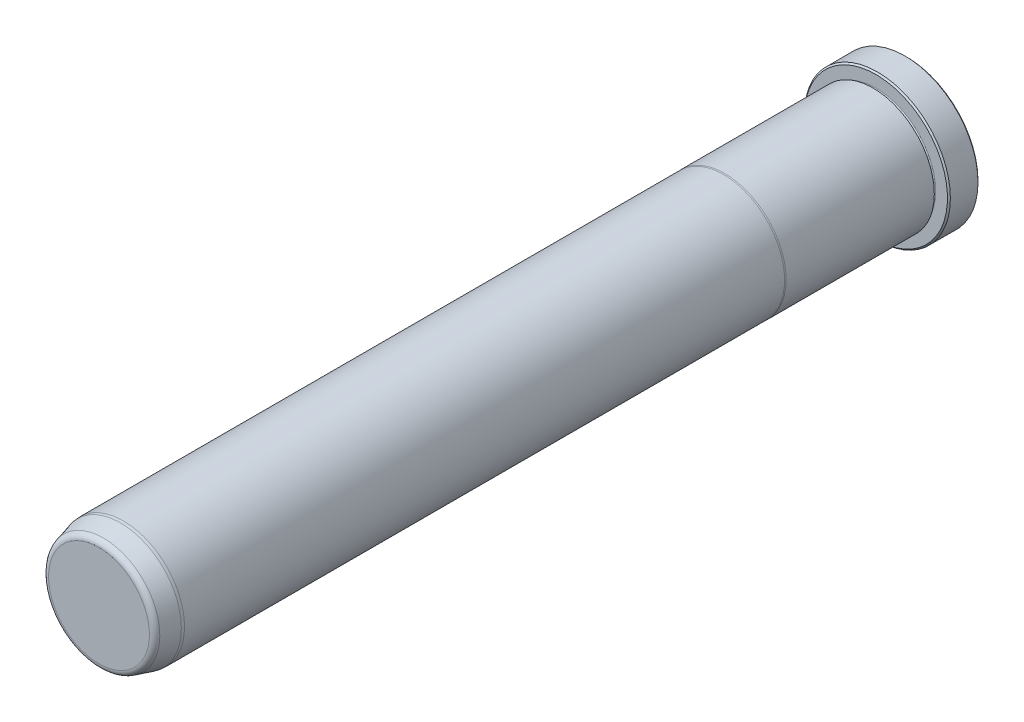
from build123d import *

# Parameters (mm, degrees)
FILLET6_R     = 1.5875
CHAMFER1_SIZE = 0.381


with BuildPart() as part:
    # Sketch1 → Revolve1 (revolve)
    with BuildSketch(Plane(origin=(0, 0, 0), x_dir=(0, 0, -1), z_dir=(1, 0, 0)), mode=Mode.PRIVATE) as revolve1_sk:
        with BuildLine():
            Line((0, 0), (0, 18.923))
            Line((0, 18.923), (-7.9248, 18.923))
            Line((-7.9248, 18.923), (-7.9248, 15.4813))
            ThreePointArc((-7.9248, 15.4813), (-8.3058, 15.1003), (-8.6868, 15.4813))
            Line((-8.6868, 15.4813), (-8.6868, 15.8877))
            Line((-8.6868, 15.8877), (-47.134763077, 15.8877))
            Line((-47.134763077, 15.8877), (-47.498, 15.8623))
            Line((-47.498, 15.8623), (-203.2, 15.8623))
            Line((-203.2, 15.8623), (-203.962, 15.795633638))
            Line((-203.962, 15.795633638), (-209.55, 14.298333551))
            Line((-209.55, 14.298333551), (-209.55, 0))
            Line((-209.55, 0), (0, 0))
        make_face()
    revolve(revolve1_sk.sketch.rotate(Axis((0, 0, 0), (0, 0, -1)), 90), axis=Axis((0, 0, 0), (0, 0, -1)))

    # Fillet6
    fillet6_edges = [part.edges().sort_by_distance(p)[0] for p in [
        (-14.298333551, 0, 209.55),
    ]]
    fillet(fillet6_edges, radius=FILLET6_R)

    # Chamfer1
    chamfer1_edges = [part.edges().sort_by_distance(p)[0] for p in [
        (-18.923, 0, 7.9248),
        (-18.923, 0, 0),
    ]]
    chamfer(chamfer1_edges, length=CHAMFER1_SIZE)


solid = part.part
